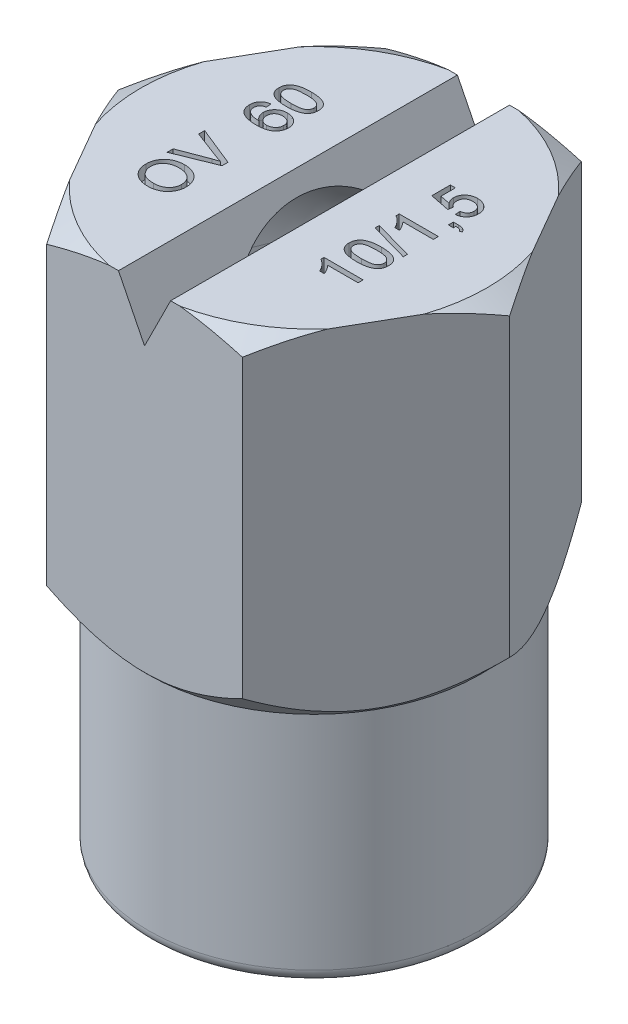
from build123d import *

# Parameters (mm, degrees)
ESTRUSIONE1_DEPTH        = 22
TAGLIO_ESTRUSIONE1_DEPTH = 27.633312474
SCHIZZO4_R               = 16.35
SCHIZZO4_R_2             = 6.35
TAGLIO_ESTRUSIONE2_DEPTH = 9
SMUSSO1_SIZE             = 1
RACCORDO1_R              = 0.5
TAGLIO_ESTRUSIONE3_DEPTH = 0.5
TAGLIO_ESTRUSIONE4_DEPTH = 0.5


with BuildPart() as part:
    # Schizzo1 → Estrusione1 (new body)
    with BuildSketch(Plane(origin=(0, 0, 0), x_dir=(1, 0, 0), z_dir=(0, 1, 0))):
        Polygon((3.75277675, -6.5), (7.505553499, 0), (3.75277675, 6.5), (-3.75277675, 6.5), (-7.505553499, 0), (-3.75277675, -6.5), align=None)
    extrude(amount=ESTRUSIONE1_DEPTH)

    # Schizzo2 → Taglio-Estrusione1 (cut, through all)
    with BuildSketch(Plane.XY.offset(6.5)):
        Polygon((-1, 22), (0, 20), (1, 22), align=None)
    extrude(amount=-TAGLIO_ESTRUSIONE1_DEPTH, mode=Mode.SUBTRACT)

    # Schizzo3 → Taglia-Rivoluzione1 (revolve, cut)
    with BuildSketch(Plane.XY, mode=Mode.PRIVATE) as taglia_rivoluzione1_sk:
        with BuildLine():
            Line((3.75, 0), (3.75, 17.65))
            ThreePointArc((3.75, 17.65), (2.651650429, 20.301650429), (0, 21.4))
            Line((0, 21.4), (0, 0))
            Line((0, 0), (3.75, 0))
        make_face()
    revolve(taglia_rivoluzione1_sk.sketch.rotate(Axis((0, 0, 0), (0, 1, 0)), 90), axis=Axis((0, 0, 0), (0, 1, 0)), mode=Mode.SUBTRACT)

    # Schizzo4 → Taglio-Estrusione2 (cut)
    with BuildSketch(Plane.XZ):
        Circle(SCHIZZO4_R)
        with Locations(Location((0, 0, 0), (0, 0, 270))):
            Circle(SCHIZZO4_R_2, mode=Mode.SUBTRACT)
    extrude(amount=-TAGLIO_ESTRUSIONE2_DEPTH, mode=Mode.SUBTRACT)

    # Schizzo5 → Taglia-Rivoluzione4 (revolve, cut)
    with BuildSketch(Plane.XY):
        Polygon((3, 24.101282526), (10.505553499, 19.767949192), (10.505553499, 24.101282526), align=None)
    revolve(axis=Axis((0, 0, 0), (0, 1, 0)), mode=Mode.SUBTRACT)

    # Schizzo6 → Taglia-Rivoluzione5 (revolve, cut)
    with BuildSketch(Plane.XY, mode=Mode.PRIVATE) as taglia_rivoluzione5_sk:
        Polygon((8.35, 11), (6.35, 9), (8.35, 9), align=None)
    revolve(taglia_rivoluzione5_sk.sketch.rotate(Axis((0, 0, 0), (0, 1, 0)), 300.000000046), axis=Axis((0, 0, 0), (0, 1, 0)), mode=Mode.SUBTRACT)

    # Smusso1
    smusso1_edges = [part.edges().sort_by_distance(p)[0] for p in [
        (0, 0, 3.75),
    ]]
    chamfer(smusso1_edges, length=SMUSSO1_SIZE)

    # Raccordo1
    raccordo1_edges = [part.edges().sort_by_distance(p)[0] for p in [
        (0, 0, 6.35),
    ]]
    fillet(raccordo1_edges, radius=RACCORDO1_R)

    # Schizzo7 → Taglio-Estrusione3 (cut)
    # profile 1 of 4: a face of its own
    with BuildSketch(Plane(origin=(0, 22, 0), x_dir=(-1, 0, 0), z_dir=(0, 1, 0))):
        with BuildLine():
            add(Edge.make_bspline(
                [(3.230168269, 3.134615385), (3.260240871, 3.134090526), (3.318835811, 3.133067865), (3.404175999, 3.1236252), (3.484374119, 3.108047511), (3.559801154, 3.086618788), (3.62988824, 3.058117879), (3.69549722, 3.024300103), (3.75548616, 2.983268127), (3.810548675, 2.936904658), (3.859223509, 2.885104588), (3.902454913, 2.829955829), (3.938514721, 2.770765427), (3.968288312, 2.708081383), (3.991147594, 2.64163708), (4.007151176, 2.571619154), (4.01747504, 2.498102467), (4.018637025, 2.447852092), (4.019230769, 2.422175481)],
                knots=[0, 0, 0, 0, 1.203593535, 2.345140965, 3.431924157, 4.471254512, 5.478692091, 6.45615896, 7.42038538, 8.382007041, 9.33218277, 10.260966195, 11.182476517, 12.100814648, 13.034113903, 13.98924309, 14.972556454, 16, 16, 16, 16], degree=3))
            add(Edge.make_bspline(
                [(4.019230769, 2.422175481), (4.01893768, 2.405239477), (4.018355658, 2.371607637), (4.013839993, 2.321796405), (4.005996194, 2.273326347), (3.995095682, 2.226162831), (3.981340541, 2.180259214), (3.964488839, 2.135521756), (3.944212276, 2.092237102), (3.921262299, 2.050291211), (3.895297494, 2.010338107), (3.867205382, 1.972415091), (3.836366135, 1.937143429), (3.80322624, 1.904312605), (3.767770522, 1.873851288), (3.729558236, 1.846138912), (3.689172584, 1.820615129), (3.646299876, 1.79782947), (3.601799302, 1.777418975), (3.555446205, 1.759984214), (3.507807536, 1.745010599), (3.458598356, 1.732477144), (3.407836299, 1.723483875), (3.355739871, 1.71632249), (3.302138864, 1.712553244), (3.265930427, 1.711879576), (3.247596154, 1.711538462)],
                knots=[0, 0, 0, 0, 1.034309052, 2.053950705, 3.051627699, 4.031038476, 5.008402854, 5.97643726, 6.948041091, 7.925482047, 8.894385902, 9.856059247, 10.805611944, 11.752954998, 12.703138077, 13.657545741, 14.63347317, 15.618750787, 16.620694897, 17.621667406, 18.641309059, 19.669521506, 20.720627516, 21.788266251, 22.880080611, 24, 24, 24, 24], degree=3))
            add(Edge.make_bspline(
                [(3.247596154, 1.711538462), (3.228959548, 1.711850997), (3.19213972, 1.712468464), (3.137745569, 1.716646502), (3.084912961, 1.723992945), (3.033484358, 1.73373675), (2.983566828, 1.746793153), (2.935017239, 1.762308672), (2.88812482, 1.781075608), (2.842776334, 1.802270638), (2.799596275, 1.826253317), (2.758883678, 1.852705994), (2.721029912, 1.881655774), (2.68553202, 1.912632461), (2.653219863, 1.946416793), (2.623145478, 1.982283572), (2.59626779, 2.020833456), (2.571826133, 2.06132541), (2.550816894, 2.103623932), (2.531955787, 2.146778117), (2.516088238, 2.190839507), (2.503106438, 2.235698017), (2.493193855, 2.281391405), (2.485963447, 2.327836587), (2.481699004, 2.37522067), (2.481080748, 2.407042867), (2.480769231, 2.423076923)],
                knots=[0, 0, 0, 0, 1.141388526, 2.255009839, 3.338557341, 4.406873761, 5.458773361, 6.496627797, 7.526383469, 8.5499449, 9.560445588, 10.548978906, 11.520676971, 12.476877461, 13.431305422, 14.380871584, 15.340724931, 16.306479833, 17.274880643, 18.230982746, 19.189541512, 20.140849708, 21.088988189, 22.051132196, 23.018035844, 24, 24, 24, 24], degree=3))
            add(Edge.make_bspline(
                [(2.480769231, 2.423076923), (2.481024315, 2.440316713), (2.481529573, 2.474464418), (2.486572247, 2.5249358), (2.494266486, 2.57415094), (2.505369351, 2.621969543), (2.519872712, 2.668316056), (2.537325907, 2.713198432), (2.557822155, 2.756725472), (2.581580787, 2.79859958), (2.60780825, 2.838781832), (2.636841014, 2.87645764), (2.668039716, 2.911734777), (2.701874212, 2.944180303), (2.737701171, 2.974304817), (2.775752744, 3.002165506), (2.816253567, 3.027338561), (2.858977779, 3.049692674), (2.902843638, 3.06984971), (2.94782757, 3.086841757), (2.99327668, 3.101771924), (3.039468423, 3.113662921), (3.086296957, 3.12313843), (3.13368417, 3.129510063), (3.181700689, 3.134111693), (3.213931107, 3.134446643), (3.230168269, 3.134615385)],
                knots=[0, 0, 0, 0, 1.072763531, 2.124875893, 3.153923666, 4.171672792, 5.177320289, 6.174136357, 7.166947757, 8.169130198, 9.168574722, 10.151174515, 11.127106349, 12.097106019, 13.066163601, 14.038804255, 15.030068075, 16.031241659, 17.038395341, 18.032966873, 19.022680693, 20.014630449, 21.000093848, 21.9946263, 22.989725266, 24, 24, 24, 24], degree=3))
        make_face()
        with BuildLine():
            add(Edge.make_bspline(
                [(3.227764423, 2.923076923), (3.206108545, 2.922752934), (3.163881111, 2.922121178), (3.102317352, 2.914886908), (3.044222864, 2.903922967), (2.989461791, 2.888766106), (2.938436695, 2.868529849), (2.891049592, 2.84378864), (2.847076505, 2.814766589), (2.807015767, 2.781478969), (2.771015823, 2.744903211), (2.739558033, 2.70581766), (2.713326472, 2.664258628), (2.691416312, 2.62077635), (2.674534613, 2.574794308), (2.662600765, 2.526532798), (2.655151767, 2.475992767), (2.65428678, 2.441532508), (2.653846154, 2.423978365)],
                knots=[0, 0, 0, 0, 1.215616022, 2.370365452, 3.475740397, 4.533490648, 5.5560781, 6.552384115, 7.530550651, 8.509299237, 9.471863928, 10.40830403, 11.321168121, 12.226759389, 13.137923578, 14.065605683, 15.014614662, 16, 16, 16, 16], degree=3))
            add(Edge.make_bspline(
                [(2.653846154, 2.423978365), (2.654292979, 2.406126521), (2.655167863, 2.37117266), (2.662491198, 2.31987291), (2.674958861, 2.271132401), (2.691556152, 2.224468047), (2.713992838, 2.18072342), (2.740266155, 2.138875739), (2.772371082, 2.100064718), (2.808435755, 2.063341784), (2.849425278, 2.030391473), (2.89435146, 2.001202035), (2.943772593, 1.977327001), (2.996977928, 1.957410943), (3.054301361, 1.941788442), (3.115742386, 1.930866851), (3.181139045, 1.924131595), (3.226044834, 1.923434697), (3.249098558, 1.923076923)],
                knots=[0, 0, 0, 0, 0.976909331, 1.912785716, 2.828990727, 3.727421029, 4.617481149, 5.514840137, 6.426786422, 7.368873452, 8.327895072, 9.299698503, 10.295216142, 11.325792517, 12.405818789, 13.542541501, 14.738390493, 16, 16, 16, 16], degree=3))
            add(Edge.make_bspline(
                [(3.249098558, 1.923076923), (3.263929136, 1.923204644), (3.293021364, 1.923455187), (3.33590364, 1.926773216), (3.377452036, 1.931053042), (3.417612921, 1.937569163), (3.456220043, 1.946549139), (3.493567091, 1.956497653), (3.529333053, 1.96893708), (3.563655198, 1.983054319), (3.596368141, 1.998840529), (3.62715708, 2.01668407), (3.65609493, 2.036237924), (3.683101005, 2.057541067), (3.708231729, 2.080518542), (3.731426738, 2.105235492), (3.752821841, 2.131752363), (3.772231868, 2.159915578), (3.789715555, 2.189280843), (3.804662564, 2.219805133), (3.817884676, 2.251065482), (3.827775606, 2.283492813), (3.836062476, 2.316562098), (3.842168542, 2.350467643), (3.845376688, 2.385453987), (3.845892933, 2.409048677), (3.846153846, 2.420973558)],
                knots=[0, 0, 0, 0, 1.220471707, 2.394123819, 3.538599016, 4.658184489, 5.740257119, 6.800339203, 7.838063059, 8.854709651, 9.853990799, 10.825506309, 11.781362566, 12.726491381, 13.654344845, 14.581758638, 15.513997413, 16.45624495, 17.395131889, 18.32430312, 19.252156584, 20.185670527, 21.111507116, 22.057642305, 23.018322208, 24, 24, 24, 24], degree=3))
            add(Edge.make_bspline(
                [(3.846153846, 2.420973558), (3.845810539, 2.437825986), (3.845131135, 2.471176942), (3.837894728, 2.52015271), (3.826787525, 2.567318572), (3.811535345, 2.612759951), (3.791102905, 2.656227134), (3.766493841, 2.698008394), (3.737360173, 2.737911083), (3.704053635, 2.775910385), (3.665612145, 2.811320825), (3.620324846, 2.841275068), (3.569234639, 2.866516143), (3.512481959, 2.887593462), (3.449624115, 2.903663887), (3.380932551, 2.914770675), (3.306334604, 2.921783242), (3.254624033, 2.922634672), (3.227764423, 2.923076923)],
                knots=[0, 0, 0, 0, 0.895069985, 1.771343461, 2.624796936, 3.468163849, 4.31361133, 5.172690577, 6.041527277, 6.935393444, 7.854933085, 8.810158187, 9.810009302, 10.877887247, 12.021813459, 13.252239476, 14.572752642, 16, 16, 16, 16], degree=3))
        make_face(mode=Mode.SUBTRACT)
    # profile 2 of 4: a face of its own
    with BuildSketch(Plane(origin=(0, 22, 0), x_dir=(-1, 0, 0), z_dir=(0, 1, 0))):
        with BuildLine():
            Line((2.5, 1.028245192), (4, 1.633112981))
            Line((4, 1.633112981), (4, 1.403846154))
            Line((4, 1.403846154), (2.924879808, 0.995793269))
            add(Edge.make_bspline(
                [(2.924879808, 0.995793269), (2.903687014, 0.987766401), (2.862260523, 0.972075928), (2.800498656, 0.950876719), (2.741157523, 0.930832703), (2.701859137, 0.91915638), (2.682692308, 0.913461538)],
                knots=[0, 0, 0, 0, 1.062769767, 2.077443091, 3.062319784, 4, 4, 4, 4], degree=3))
            add(Edge.make_bspline(
                [(2.682692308, 0.913461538), (2.723198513, 0.901262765), (2.804791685, 0.876690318), (2.884660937, 0.846988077), (2.924879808, 0.83203125)],
                knots=[0, 0, 0, 0, 0.992882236, 2, 2, 2, 2], degree=3))
            Line((2.924879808, 0.83203125), (4, 0.423076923))
            Line((4, 0.423076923), (4, 0.193810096))
            Line((4, 0.193810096), (2.5, 0.798978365))
            Line((2.5, 0.798978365), (2.5, 1.028245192))
        make_face()
    # profile 3 of 4: a face of its own
    with BuildSketch(Plane(origin=(0, 22, 0), x_dir=(-1, 0, 0), z_dir=(0, 1, 0))):
        with BuildLine():
            Line((3.615384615, -1.961538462), (3.596153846, -1.769230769))
            add(Edge.make_bspline(
                [(3.596153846, -1.769230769), (3.612693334, -1.765080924), (3.643826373, -1.757269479), (3.686053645, -1.740888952), (3.721770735, -1.72283796), (3.741003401, -1.707155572), (3.75, -1.699819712)],
                knots=[0, 0, 0, 0, 1.199207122, 2.257322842, 3.184815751, 4, 4, 4, 4], degree=3))
            add(Edge.make_bspline(
                [(3.75, -1.699819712), (3.756136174, -1.693522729), (3.768204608, -1.681138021), (3.783935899, -1.660806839), (3.797264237, -1.639374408), (3.808062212, -1.616775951), (3.816591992, -1.593133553), (3.822559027, -1.568349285), (3.826252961, -1.542479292), (3.826697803, -1.524852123), (3.826923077, -1.515925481)],
                knots=[0, 0, 0, 0, 1.028360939, 2.022547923, 3.001693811, 3.976902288, 4.948369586, 5.937776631, 6.955661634, 8, 8, 8, 8], degree=3))
            add(Edge.make_bspline(
                [(3.826923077, -1.515925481), (3.826457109, -1.501453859), (3.825536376, -1.472858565), (3.81652247, -1.430904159), (3.803031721, -1.390154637), (3.789356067, -1.364908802), (3.782451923, -1.352163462)],
                knots=[0, 0, 0, 0, 1.010336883, 1.996381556, 2.988474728, 4, 4, 4, 4], degree=3))
            add(Edge.make_bspline(
                [(3.782451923, -1.352163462), (3.772063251, -1.339634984), (3.750737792, -1.313917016), (3.711449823, -1.280280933), (3.66538697, -1.250666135), (3.622701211, -1.228390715), (3.584232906, -1.21294135), (3.551454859, -1.202378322), (3.51503182, -1.193902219), (3.475318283, -1.186684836), (3.432175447, -1.181148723), (3.385599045, -1.176507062), (3.335464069, -1.17394308), (3.300883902, -1.173371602), (3.283052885, -1.173076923)],
                knots=[0, 0, 0, 0, 1.063450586, 2.183009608, 3.366294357, 4.641264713, 5.326401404, 6.07664488, 6.892063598, 7.77129542, 8.7166684, 9.737191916, 10.833199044, 12, 12, 12, 12], degree=3))
            add(Edge.make_bspline(
                [(3.283052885, -1.173076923), (3.298977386, -1.184418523), (3.330150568, -1.206620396), (3.371063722, -1.245774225), (3.405335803, -1.288792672), (3.432985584, -1.335202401), (3.454229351, -1.383978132), (3.469704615, -1.434036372), (3.47906848, -1.485426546), (3.480199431, -1.520093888), (3.480769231, -1.537560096)],
                knots=[0, 0, 0, 0, 1.084049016, 2.12209208, 3.130949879, 4.128207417, 5.11149915, 6.076901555, 7.031098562, 8, 8, 8, 8], degree=3))
            add(Edge.make_bspline(
                [(3.480769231, -1.537560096), (3.480365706, -1.552604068), (3.479568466, -1.582326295), (3.473213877, -1.626087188), (3.462219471, -1.667982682), (3.447552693, -1.708402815), (3.428088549, -1.74681276), (3.404934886, -1.783864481), (3.376914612, -1.818734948), (3.345405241, -1.851890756), (3.310380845, -1.882080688), (3.272682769, -1.908800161), (3.232222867, -1.931066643), (3.189271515, -1.949122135), (3.143985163, -1.963253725), (3.096235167, -1.973522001), (3.045927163, -1.979532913), (3.011534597, -1.980351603), (2.993990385, -1.980769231)],
                knots=[0, 0, 0, 0, 0.981571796, 1.939281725, 2.877861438, 3.804367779, 4.739823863, 5.68285443, 6.650639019, 7.653910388, 8.664247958, 9.663507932, 10.664113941, 11.671783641, 12.699293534, 13.755733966, 14.85516306, 16, 16, 16, 16], degree=3))
            add(Edge.make_bspline(
                [(2.993990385, -1.980769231), (2.970806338, -1.980016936), (2.925053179, -1.978532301), (2.85764103, -1.966738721), (2.792836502, -1.947430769), (2.741054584, -1.92527508), (2.702050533, -1.903651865), (2.674220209, -1.886285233), (2.648323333, -1.867175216), (2.623893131, -1.846946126), (2.60173865, -1.824715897), (2.580767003, -1.801759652), (2.562201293, -1.776802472), (2.544985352, -1.750855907), (2.530092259, -1.723389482), (2.516757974, -1.695169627), (2.50561325, -1.665934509), (2.49667544, -1.63576241), (2.489358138, -1.604788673), (2.484313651, -1.572851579), (2.481205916, -1.540026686), (2.48091592, -1.517835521), (2.480769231, -1.506610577)],
                knots=[0, 0, 0, 0, 1.777725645, 3.508298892, 5.231915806, 6.956149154, 7.815891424, 8.651536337, 9.470662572, 10.283276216, 11.081966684, 11.876395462, 12.66627801, 13.465448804, 14.263251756, 15.060721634, 15.858413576, 16.660607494, 17.473221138, 18.298093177, 19.139125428, 20, 20, 20, 20], degree=3))
            add(Edge.make_bspline(
                [(2.480769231, -1.506610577), (2.481296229, -1.487654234), (2.482329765, -1.450477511), (2.490231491, -1.396054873), (2.503558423, -1.344321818), (2.521833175, -1.295188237), (2.545450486, -1.248760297), (2.574621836, -1.205199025), (2.608986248, -1.16431695), (2.64856124, -1.126056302), (2.69439319, -1.091493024), (2.746908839, -1.061361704), (2.806544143, -1.036681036), (2.87255488, -1.015835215), (2.945565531, -1.000401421), (3.025104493, -0.988498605), (3.111478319, -0.982238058), (3.171265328, -0.981270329), (3.202223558, -0.980769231)],
                knots=[0, 0, 0, 0, 0.898449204, 1.762016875, 2.600428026, 3.426826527, 4.242280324, 5.064055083, 5.906691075, 6.769749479, 7.668135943, 8.621070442, 9.631748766, 10.722023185, 11.898351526, 13.165512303, 14.532277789, 16, 16, 16, 16], degree=3))
            add(Edge.make_bspline(
                [(3.202223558, -0.980769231), (3.219852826, -0.980890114), (3.254619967, -0.981128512), (3.30583194, -0.982845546), (3.3552207, -0.986231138), (3.402721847, -0.990681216), (3.44841142, -0.996414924), (3.492259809, -1.003145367), (3.534205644, -1.011732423), (3.574341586, -1.021180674), (3.612695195, -1.032141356), (3.649314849, -1.043919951), (3.683932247, -1.057590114), (3.716757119, -1.072262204), (3.747741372, -1.088227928), (3.777004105, -1.105225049), (3.804169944, -1.124013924), (3.821185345, -1.137526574), (3.829627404, -1.144230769)],
                knots=[0, 0, 0, 0, 1.280444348, 2.525197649, 3.720942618, 4.875526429, 5.989898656, 7.065115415, 8.096622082, 9.098853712, 10.059152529, 10.993162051, 11.891531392, 12.760921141, 13.603603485, 14.422073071, 15.217123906, 16, 16, 16, 16], degree=3))
            add(Edge.make_bspline(
                [(3.829627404, -1.144230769), (3.843252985, -1.156344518), (3.870110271, -1.180221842), (3.904803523, -1.221068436), (3.934436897, -1.264593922), (3.958378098, -1.311492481), (3.977043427, -1.361405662), (3.990592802, -1.414364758), (3.998450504, -1.470517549), (3.99947513, -1.50888945), (4, -1.528545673)],
                knots=[0, 0, 0, 0, 1.005002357, 1.980952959, 2.948226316, 3.90482984, 4.879026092, 5.883055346, 6.915583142, 8, 8, 8, 8], degree=3))
            add(Edge.make_bspline(
                [(4, -1.528545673), (3.999741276, -1.543181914), (3.999232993, -1.571935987), (3.994355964, -1.614068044), (3.986204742, -1.654143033), (3.975209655, -1.692250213), (3.96057379, -1.728168), (3.943228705, -1.762310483), (3.922363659, -1.794330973), (3.898263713, -1.823997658), (3.871612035, -1.851384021), (3.842184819, -1.875913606), (3.810348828, -1.897493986), (3.776037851, -1.916293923), (3.739414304, -1.932145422), (3.700320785, -1.945160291), (3.658767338, -1.955052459), (3.630045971, -1.959346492), (3.615384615, -1.961538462)],
                knots=[0, 0, 0, 0, 1.095988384, 2.15315746, 3.171326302, 4.156539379, 5.119213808, 6.072133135, 7.021027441, 7.975952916, 8.930907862, 9.879001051, 10.840359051, 11.807350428, 12.805278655, 13.825435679, 14.889953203, 16, 16, 16, 16], degree=3))
        make_face()
        with BuildLine():
            add(Edge.make_bspline(
                [(2.997896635, -1.173076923), (2.98283903, -1.173611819), (2.952921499, -1.174674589), (2.908514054, -1.18280357), (2.865186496, -1.196078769), (2.823420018, -1.21427258), (2.784614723, -1.236738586), (2.750230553, -1.263422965), (2.720772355, -1.293746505), (2.696176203, -1.327546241), (2.677274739, -1.364742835), (2.663585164, -1.404670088), (2.655311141, -1.447375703), (2.654341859, -1.476825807), (2.653846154, -1.491887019)],
                knots=[0, 0, 0, 0, 1.034121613, 2.054667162, 3.090870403, 4.141799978, 5.178094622, 6.163726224, 7.122467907, 8.07367165, 9.024701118, 9.977919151, 10.965878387, 12, 12, 12, 12], degree=3))
            add(Edge.make_bspline(
                [(2.653846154, -1.491887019), (2.654135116, -1.502620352), (2.654699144, -1.52357087), (2.659107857, -1.554237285), (2.665771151, -1.583437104), (2.675969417, -1.611033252), (2.688453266, -1.637217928), (2.704057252, -1.661860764), (2.722343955, -1.684968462), (2.743428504, -1.706291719), (2.766871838, -1.725565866), (2.792537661, -1.742311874), (2.820001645, -1.757100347), (2.849939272, -1.768223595), (2.881583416, -1.777287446), (2.915233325, -1.783951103), (2.950927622, -1.787863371), (2.975450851, -1.788259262), (2.987980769, -1.788461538)],
                knots=[0, 0, 0, 0, 1.023462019, 1.997707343, 2.950204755, 3.875082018, 4.798131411, 5.712685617, 6.65128003, 7.603921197, 8.567945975, 9.540503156, 10.523517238, 11.53671457, 12.580096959, 13.661292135, 14.805058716, 16, 16, 16, 16], degree=3))
            add(Edge.make_bspline(
                [(2.987980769, -1.788461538), (3.000012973, -1.788273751), (3.023543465, -1.787906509), (3.057881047, -1.783780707), (3.090336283, -1.777757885), (3.120663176, -1.768556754), (3.149043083, -1.757132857), (3.175657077, -1.74336446), (3.200183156, -1.72673901), (3.2223571, -1.707374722), (3.242521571, -1.686147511), (3.260163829, -1.662819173), (3.274786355, -1.637510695), (3.287008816, -1.610475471), (3.296280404, -1.581524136), (3.302723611, -1.550700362), (3.307216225, -1.518160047), (3.307531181, -1.495809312), (3.307692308, -1.484375)],
                knots=[0, 0, 0, 0, 1.155383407, 2.259498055, 3.31823029, 4.322885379, 5.298549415, 6.25407473, 7.196229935, 8.137696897, 9.077096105, 10.004740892, 10.940535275, 11.8794908, 12.850254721, 13.854356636, 14.902319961, 16, 16, 16, 16], degree=3))
            add(Edge.make_bspline(
                [(3.307692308, -1.484375), (3.30752628, -1.473740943), (3.307199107, -1.452785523), (3.302668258, -1.422055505), (3.296223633, -1.39243306), (3.286815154, -1.364059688), (3.274850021, -1.336919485), (3.25984063, -1.311177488), (3.242524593, -1.28648581), (3.222313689, -1.26350833), (3.20040774, -1.242236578), (3.176405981, -1.223708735), (3.150763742, -1.208109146), (3.123491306, -1.194912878), (3.094377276, -1.185157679), (3.063662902, -1.178244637), (3.031370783, -1.173951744), (3.009228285, -1.173373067), (2.997896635, -1.173076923)],
                knots=[0, 0, 0, 0, 1.037172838, 2.043847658, 3.025909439, 3.99370322, 4.956694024, 5.916004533, 6.898066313, 7.896061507, 8.898787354, 9.874696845, 10.848988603, 11.824261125, 12.826080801, 13.838909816, 14.894039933, 16, 16, 16, 16], degree=3))
        make_face(mode=Mode.SUBTRACT)
    # profile 4 of 4: a face of its own
    with BuildSketch(Plane(origin=(0, 22, 0), x_dir=(-1, 0, 0), z_dir=(0, 1, 0))):
        with BuildLine():
            add(Edge.make_bspline(
                [(3.239783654, -2.173076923), (3.261220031, -2.173270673), (3.303204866, -2.173650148), (3.364636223, -2.176003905), (3.422975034, -2.180113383), (3.478170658, -2.18624767), (3.530347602, -2.193511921), (3.579431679, -2.202955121), (3.625532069, -2.213581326), (3.668603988, -2.226326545), (3.709006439, -2.240344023), (3.746714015, -2.256195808), (3.781503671, -2.274187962), (3.814320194, -2.292698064), (3.843626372, -2.314248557), (3.871278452, -2.336103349), (3.895697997, -2.360497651), (3.917684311, -2.386271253), (3.937079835, -2.413851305), (3.953817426, -2.443079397), (3.968595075, -2.473846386), (3.979719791, -2.506737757), (3.988788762, -2.541070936), (3.995460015, -2.577110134), (3.999392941, -2.614895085), (3.999795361, -2.640715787), (4, -2.653846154)],
                knots=[0, 0, 0, 0, 1.514715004, 2.966688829, 4.343277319, 5.646155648, 6.890271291, 8.064567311, 9.176982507, 10.231801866, 11.236819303, 12.197732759, 13.118802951, 14.00370591, 14.856056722, 15.686168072, 16.491905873, 17.290274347, 18.077650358, 18.870352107, 19.668187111, 20.485160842, 21.319455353, 22.17593919, 23.072426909, 24, 24, 24, 24], degree=3))
            add(Edge.make_bspline(
                [(4, -2.653846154), (3.999433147, -2.673109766), (3.998319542, -2.710953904), (3.989252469, -2.766212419), (3.973703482, -2.818267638), (3.952890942, -2.867111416), (3.925968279, -2.911687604), (3.894081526, -2.951988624), (3.855895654, -2.98638614), (3.812663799, -3.01601639), (3.764300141, -3.041424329), (3.711260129, -3.064152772), (3.653318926, -3.084530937), (3.601600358, -3.099446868), (3.556879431, -3.109904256), (3.519925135, -3.116271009), (3.480173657, -3.122149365), (3.437529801, -3.126316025), (3.392192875, -3.13055594), (3.34396519, -3.132649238), (3.292879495, -3.134246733), (3.25781406, -3.134490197), (3.239783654, -3.134615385)],
                knots=[0, 0, 0, 0, 1.134508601, 2.228787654, 3.287419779, 4.328790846, 5.347871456, 6.346850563, 7.345149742, 8.363256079, 9.427154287, 10.558404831, 11.760335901, 13.043439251, 13.7276639, 14.464993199, 15.251939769, 16.09452972, 16.988861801, 17.934185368, 18.937772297, 20, 20, 20, 20], degree=3))
            add(Edge.make_bspline(
                [(3.239783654, -3.134615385), (3.218447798, -3.134419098), (3.176764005, -3.134035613), (3.115827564, -3.13172975), (3.05792065, -3.127426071), (3.002972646, -3.121880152), (2.950932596, -3.114413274), (2.901927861, -3.105080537), (2.855898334, -3.094301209), (2.812797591, -3.082102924), (2.772566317, -3.067911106), (2.735011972, -3.05190461), (2.699766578, -3.034740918), (2.667486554, -3.015272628), (2.637637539, -2.994537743), (2.610125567, -2.972342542), (2.585341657, -2.948227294), (2.563427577, -2.922213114), (2.543683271, -2.894829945), (2.526793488, -2.865525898), (2.512703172, -2.834369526), (2.500926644, -2.801638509), (2.491976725, -2.767115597), (2.485331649, -2.730980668), (2.481362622, -2.692997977), (2.480969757, -2.667076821), (2.480769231, -2.653846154)],
                knots=[0, 0, 0, 0, 1.50892112, 2.947974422, 4.311604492, 5.614840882, 6.853004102, 8.028299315, 9.14166105, 10.195403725, 11.194594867, 12.156325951, 13.08133133, 13.964490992, 14.819271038, 15.650088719, 16.461567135, 17.260614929, 18.05275699, 18.846133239, 19.648095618, 20.468123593, 21.303127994, 22.167306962, 23.06455749, 24, 24, 24, 24], degree=3))
            add(Edge.make_bspline(
                [(2.480769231, -2.653846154), (2.481264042, -2.636499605), (2.482228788, -2.602678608), (2.488783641, -2.553285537), (2.500320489, -2.506927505), (2.51579303, -2.463213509), (2.536488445, -2.422634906), (2.561668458, -2.384997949), (2.59074723, -2.349546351), (2.613689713, -2.329138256), (2.625300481, -2.318810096)],
                knots=[0, 0, 0, 0, 1.10322584, 2.150986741, 3.161425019, 4.136713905, 5.093944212, 6.049774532, 7.013026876, 8, 8, 8, 8], degree=3))
            add(Edge.make_bspline(
                [(2.625300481, -2.318810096), (2.642449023, -2.306922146), (2.677810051, -2.282408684), (2.738103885, -2.253717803), (2.80447893, -2.228125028), (2.878237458, -2.208039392), (2.958792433, -2.192307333), (3.046301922, -2.180944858), (3.140728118, -2.174514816), (3.206019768, -2.173567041), (3.239783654, -2.173076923)],
                knots=[0, 0, 0, 0, 0.779365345, 1.607084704, 2.489375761, 3.438383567, 4.461919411, 5.557722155, 6.737039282, 8, 8, 8, 8], degree=3))
        make_face()
        with BuildLine():
            add(Edge.make_bspline(
                [(3.240384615, -2.365384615), (3.21153416, -2.365575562), (3.156308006, -2.365941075), (3.077407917, -2.369759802), (3.006229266, -2.376333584), (2.942870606, -2.385024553), (2.887246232, -2.396500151), (2.83949789, -2.410909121), (2.799052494, -2.427151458), (2.766411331, -2.447251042), (2.739804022, -2.469257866), (2.716920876, -2.491978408), (2.697470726, -2.515947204), (2.681253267, -2.54100786), (2.668974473, -2.56754921), (2.660074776, -2.59528103), (2.654953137, -2.624209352), (2.654217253, -2.643910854), (2.653846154, -2.653846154)],
                knots=[0, 0, 0, 0, 1.89448813, 3.626469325, 5.185477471, 6.587276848, 7.82441448, 8.910550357, 9.859733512, 10.6775885, 11.416198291, 12.123144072, 12.791880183, 13.439617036, 14.078171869, 14.70637855, 15.347637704, 16, 16, 16, 16], degree=3))
            add(Edge.make_bspline(
                [(2.653846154, -2.653846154), (2.654225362, -2.663778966), (2.654977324, -2.683475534), (2.659986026, -2.712470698), (2.669343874, -2.740094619), (2.6815793, -2.766596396), (2.697427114, -2.791839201), (2.716950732, -2.815690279), (2.73982029, -2.838530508), (2.766736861, -2.860438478), (2.799528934, -2.880384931), (2.839941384, -2.896931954), (2.887773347, -2.911116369), (2.943369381, -2.922654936), (3.006627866, -2.931381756), (3.077609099, -2.937915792), (3.15640767, -2.941760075), (3.211534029, -2.942119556), (3.240384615, -2.942307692)],
                knots=[0, 0, 0, 0, 0.652509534, 1.29391342, 1.924290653, 2.562989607, 3.207355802, 3.876242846, 4.583348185, 5.32723334, 6.150888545, 7.094226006, 8.186903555, 9.424320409, 10.81992305, 12.379283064, 14.105084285, 16, 16, 16, 16], degree=3))
            add(Edge.make_bspline(
                [(3.240384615, -2.942307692), (3.268634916, -2.942125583), (3.322761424, -2.941776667), (3.40014147, -2.937833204), (3.470125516, -2.931653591), (3.53277753, -2.923200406), (3.588031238, -2.911967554), (3.635998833, -2.898339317), (3.67659476, -2.882112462), (3.7101751, -2.862778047), (3.737894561, -2.841340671), (3.761420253, -2.818564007), (3.782036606, -2.794888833), (3.798179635, -2.768962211), (3.811419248, -2.74188632), (3.820282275, -2.71308074), (3.825970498, -2.682917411), (3.826600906, -2.662286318), (3.826923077, -2.651742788)],
                knots=[0, 0, 0, 0, 1.850145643, 3.544809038, 5.072983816, 6.450691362, 7.683229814, 8.76276662, 9.712991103, 10.538891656, 11.292051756, 12.001912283, 12.681449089, 13.342071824, 13.996410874, 14.649960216, 15.310061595, 16, 16, 16, 16], degree=3))
            add(Edge.make_bspline(
                [(3.826923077, -2.651742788), (3.826662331, -2.641808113), (3.826148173, -2.622218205), (3.821240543, -2.593536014), (3.81303389, -2.566354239), (3.801917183, -2.540361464), (3.786956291, -2.516206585), (3.769488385, -2.492931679), (3.74820569, -2.471626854), (3.732295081, -2.458788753), (3.724158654, -2.452223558)],
                knots=[0, 0, 0, 0, 1.021318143, 2.013908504, 2.982026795, 3.937174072, 4.91255697, 5.897578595, 6.924855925, 8, 8, 8, 8], degree=3))
            add(Edge.make_bspline(
                [(3.724158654, -2.452223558), (3.712208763, -2.445076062), (3.68697311, -2.429982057), (3.643112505, -2.413092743), (3.592988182, -2.398173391), (3.535828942, -2.385889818), (3.471732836, -2.377003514), (3.4007743, -2.369988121), (3.322854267, -2.366343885), (3.268632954, -2.365713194), (3.240384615, -2.365384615)],
                knots=[0, 0, 0, 0, 0.671104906, 1.417232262, 2.260109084, 3.195198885, 4.23592645, 5.382417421, 6.636286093, 8, 8, 8, 8], degree=3))
        make_face(mode=Mode.SUBTRACT)
    extrude(amount=-TAGLIO_ESTRUSIONE3_DEPTH, mode=Mode.SUBTRACT)

    # Schizzo8 → Taglio-Estrusione4 (cut)
    # profile 1 of 6: a face of its own
    with BuildSketch(Plane(origin=(0, 22, 0), x_dir=(-1, 0, 0), z_dir=(0, 1, 0))):
        with BuildLine():
            Line((-4, 2.115384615), (-4, 2.307692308))
            Line((-4, 2.307692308), (-2.831129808, 2.307692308))
            add(Edge.make_bspline(
                [(-2.831129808, 2.307692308), (-2.841807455, 2.318766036), (-2.863999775, 2.341781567), (-2.895427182, 2.38067387), (-2.927141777, 2.424073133), (-2.958052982, 2.471259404), (-2.986582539, 2.519729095), (-3.012615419, 2.566426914), (-3.034532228, 2.610700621), (-3.046527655, 2.639855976), (-3.052283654, 2.653846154)],
                knots=[0, 0, 0, 0, 0.89334793, 1.85672577, 2.901900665, 4.015525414, 5.132247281, 6.168817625, 7.121308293, 8, 8, 8, 8], degree=3))
            Line((-3.052283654, 2.653846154), (-2.875, 2.653846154))
            add(Edge.make_bspline(
                [(-2.875, 2.653846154), (-2.862624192, 2.629815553), (-2.838232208, 2.58245266), (-2.796103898, 2.515539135), (-2.750435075, 2.453068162), (-2.701235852, 2.396073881), (-2.650945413, 2.344982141), (-2.600200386, 2.301926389), (-2.550860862, 2.265900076), (-2.516452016, 2.247824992), (-2.5, 2.239182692)],
                knots=[0, 0, 0, 0, 1.141258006, 2.249351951, 3.335817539, 4.406819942, 5.426913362, 6.360259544, 7.215985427, 8, 8, 8, 8], degree=3))
            Line((-2.5, 2.239182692), (-2.5, 2.115384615))
            Line((-2.5, 2.115384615), (-4, 2.115384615))
        make_face()
    # profile 2 of 6: a face of its own
    with BuildSketch(Plane(origin=(0, 22, 0), x_dir=(-1, 0, 0), z_dir=(0, 1, 0))):
        with BuildLine():
            add(Edge.make_bspline(
                [(-3.260216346, 1.634615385), (-3.238779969, 1.634421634), (-3.196795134, 1.634042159), (-3.135363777, 1.631688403), (-3.077024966, 1.627578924), (-3.021829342, 1.621444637), (-2.969652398, 1.614180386), (-2.920568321, 1.604737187), (-2.874467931, 1.594110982), (-2.831396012, 1.581365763), (-2.790993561, 1.567348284), (-2.753285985, 1.551496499), (-2.718496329, 1.533504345), (-2.685679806, 1.514994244), (-2.656373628, 1.493443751), (-2.628721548, 1.471588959), (-2.604302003, 1.447194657), (-2.582315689, 1.421421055), (-2.562920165, 1.393841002), (-2.546182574, 1.364612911), (-2.531404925, 1.333845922), (-2.520280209, 1.300954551), (-2.511211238, 1.266621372), (-2.504539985, 1.230582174), (-2.500607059, 1.192797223), (-2.500204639, 1.166976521), (-2.5, 1.153846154)],
                knots=[0, 0, 0, 0, 1.514715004, 2.966688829, 4.343277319, 5.646155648, 6.890271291, 8.064567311, 9.176982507, 10.231801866, 11.236819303, 12.197732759, 13.118802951, 14.00370591, 14.856056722, 15.686168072, 16.491905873, 17.290274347, 18.077650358, 18.870352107, 19.668187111, 20.485160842, 21.319455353, 22.17593919, 23.072426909, 24, 24, 24, 24], degree=3))
            add(Edge.make_bspline(
                [(-2.5, 1.153846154), (-2.500566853, 1.134582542), (-2.501680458, 1.096738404), (-2.510747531, 1.041479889), (-2.526296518, 0.98942467), (-2.547109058, 0.940580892), (-2.574031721, 0.896004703), (-2.605918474, 0.855703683), (-2.644104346, 0.821306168), (-2.687336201, 0.791675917), (-2.735699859, 0.766267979), (-2.788739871, 0.743539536), (-2.846681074, 0.723161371), (-2.898399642, 0.70824544), (-2.943120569, 0.697788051), (-2.980074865, 0.691421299), (-3.019826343, 0.685542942), (-3.062470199, 0.681376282), (-3.107807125, 0.677136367), (-3.15603481, 0.67504307), (-3.207120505, 0.673445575), (-3.24218594, 0.673202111), (-3.260216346, 0.673076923)],
                knots=[0, 0, 0, 0, 1.134508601, 2.228787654, 3.287419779, 4.328790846, 5.347871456, 6.346850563, 7.345149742, 8.363256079, 9.427154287, 10.558404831, 11.760335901, 13.043439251, 13.7276639, 14.464993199, 15.251939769, 16.09452972, 16.988861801, 17.934185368, 18.937772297, 20, 20, 20, 20], degree=3))
            add(Edge.make_bspline(
                [(-3.260216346, 0.673076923), (-3.281552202, 0.67327321), (-3.323235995, 0.673656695), (-3.384172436, 0.675962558), (-3.44207935, 0.680266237), (-3.497027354, 0.685812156), (-3.549067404, 0.693279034), (-3.598072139, 0.702611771), (-3.644101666, 0.713391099), (-3.687202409, 0.725589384), (-3.727433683, 0.739781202), (-3.764988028, 0.755787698), (-3.800233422, 0.772951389), (-3.832513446, 0.79241968), (-3.862362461, 0.813154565), (-3.889874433, 0.835349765), (-3.914658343, 0.859465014), (-3.936572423, 0.885479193), (-3.956316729, 0.912862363), (-3.973206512, 0.94216641), (-3.987296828, 0.973322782), (-3.999073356, 1.006053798), (-4.008023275, 1.040576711), (-4.014668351, 1.07671164), (-4.018637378, 1.114694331), (-4.019030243, 1.140615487), (-4.019230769, 1.153846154)],
                knots=[0, 0, 0, 0, 1.50892112, 2.947974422, 4.311604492, 5.614840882, 6.853004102, 8.028299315, 9.14166105, 10.195403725, 11.194594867, 12.156325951, 13.08133133, 13.964490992, 14.819271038, 15.650088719, 16.461567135, 17.260614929, 18.05275699, 18.846133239, 19.648095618, 20.468123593, 21.303127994, 22.167306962, 23.06455749, 24, 24, 24, 24], degree=3))
            add(Edge.make_bspline(
                [(-4.019230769, 1.153846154), (-4.018735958, 1.171192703), (-4.017771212, 1.205013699), (-4.011216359, 1.254406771), (-3.999679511, 1.300764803), (-3.98420697, 1.344478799), (-3.963511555, 1.385057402), (-3.938331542, 1.422694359), (-3.90925277, 1.458145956), (-3.886310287, 1.478554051), (-3.874699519, 1.488882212)],
                knots=[0, 0, 0, 0, 1.10322584, 2.150986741, 3.161425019, 4.136713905, 5.093944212, 6.049774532, 7.013026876, 8, 8, 8, 8], degree=3))
            add(Edge.make_bspline(
                [(-3.874699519, 1.488882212), (-3.857550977, 1.500770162), (-3.822189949, 1.525283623), (-3.761896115, 1.553974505), (-3.69552107, 1.57956728), (-3.621762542, 1.599652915), (-3.541207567, 1.615384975), (-3.453698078, 1.62674745), (-3.359271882, 1.633177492), (-3.293980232, 1.634125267), (-3.260216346, 1.634615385)],
                knots=[0, 0, 0, 0, 0.779365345, 1.607084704, 2.489375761, 3.438383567, 4.461919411, 5.557722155, 6.737039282, 8, 8, 8, 8], degree=3))
        make_face()
        with BuildLine():
            add(Edge.make_bspline(
                [(-3.259615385, 1.442307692), (-3.28846584, 1.442116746), (-3.343691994, 1.441751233), (-3.422592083, 1.437932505), (-3.493770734, 1.431358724), (-3.557129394, 1.422667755), (-3.612753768, 1.411192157), (-3.66050211, 1.396783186), (-3.700947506, 1.38054085), (-3.733588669, 1.360441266), (-3.760195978, 1.338434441), (-3.783079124, 1.315713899), (-3.802529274, 1.291745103), (-3.818746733, 1.266684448), (-3.831025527, 1.240143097), (-3.839925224, 1.212411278), (-3.845046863, 1.183482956), (-3.845782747, 1.163781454), (-3.846153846, 1.153846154)],
                knots=[0, 0, 0, 0, 1.89448813, 3.626469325, 5.185477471, 6.587276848, 7.82441448, 8.910550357, 9.859733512, 10.6775885, 11.416198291, 12.123144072, 12.791880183, 13.439617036, 14.078171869, 14.70637855, 15.347637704, 16, 16, 16, 16], degree=3))
            add(Edge.make_bspline(
                [(-3.846153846, 1.153846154), (-3.845774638, 1.143913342), (-3.845022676, 1.124216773), (-3.840013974, 1.095221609), (-3.830656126, 1.067597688), (-3.8184207, 1.041095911), (-3.802572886, 1.015853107), (-3.783049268, 0.992002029), (-3.76017971, 0.9691618), (-3.733263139, 0.947253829), (-3.700471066, 0.927307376), (-3.660058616, 0.910760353), (-3.612226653, 0.896575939), (-3.556630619, 0.885037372), (-3.493372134, 0.876310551), (-3.422390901, 0.869776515), (-3.34359233, 0.865932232), (-3.288465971, 0.865572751), (-3.259615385, 0.865384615)],
                knots=[0, 0, 0, 0, 0.652509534, 1.29391342, 1.924290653, 2.562989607, 3.207355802, 3.876242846, 4.583348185, 5.32723334, 6.150888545, 7.094226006, 8.186903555, 9.424320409, 10.81992305, 12.379283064, 14.105084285, 16, 16, 16, 16], degree=3))
            add(Edge.make_bspline(
                [(-3.259615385, 0.865384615), (-3.231365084, 0.865566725), (-3.177238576, 0.86591564), (-3.09985853, 0.869859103), (-3.029874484, 0.876038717), (-2.96722247, 0.884491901), (-2.911968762, 0.895724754), (-2.864001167, 0.909352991), (-2.82340524, 0.925579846), (-2.7898249, 0.94491426), (-2.762105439, 0.966351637), (-2.738579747, 0.989128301), (-2.717963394, 1.012803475), (-2.701820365, 1.038730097), (-2.688580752, 1.065805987), (-2.679717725, 1.094611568), (-2.674029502, 1.124774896), (-2.673399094, 1.14540599), (-2.673076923, 1.155949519)],
                knots=[0, 0, 0, 0, 1.850145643, 3.544809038, 5.072983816, 6.450691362, 7.683229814, 8.76276662, 9.712991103, 10.538891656, 11.292051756, 12.001912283, 12.681449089, 13.342071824, 13.996410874, 14.649960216, 15.310061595, 16, 16, 16, 16], degree=3))
            add(Edge.make_bspline(
                [(-2.673076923, 1.155949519), (-2.673337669, 1.165884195), (-2.673851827, 1.185474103), (-2.678759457, 1.214156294), (-2.68696611, 1.241338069), (-2.698082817, 1.267330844), (-2.713043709, 1.291485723), (-2.730511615, 1.314760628), (-2.75179431, 1.336065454), (-2.767704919, 1.348903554), (-2.775841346, 1.35546875)],
                knots=[0, 0, 0, 0, 1.021318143, 2.013908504, 2.982026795, 3.937174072, 4.91255697, 5.897578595, 6.924855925, 8, 8, 8, 8], degree=3))
            add(Edge.make_bspline(
                [(-2.775841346, 1.35546875), (-2.787791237, 1.362616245), (-2.81302689, 1.37771025), (-2.856887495, 1.394599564), (-2.907011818, 1.409518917), (-2.964171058, 1.42180249), (-3.028267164, 1.430688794), (-3.0992257, 1.437704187), (-3.177145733, 1.441348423), (-3.231367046, 1.441979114), (-3.259615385, 1.442307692)],
                knots=[0, 0, 0, 0, 0.671104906, 1.417232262, 2.260109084, 3.195198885, 4.23592645, 5.382417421, 6.636286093, 8, 8, 8, 8], degree=3))
        make_face(mode=Mode.SUBTRACT)
    # profile 3 of 6: a face of its own
    with BuildSketch(Plane(origin=(0, 22, 0), x_dir=(-1, 0, 0), z_dir=(0, 1, 0))):
        Polygon((-4, 0.576923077), (-2.5, 0.153846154), (-2.5, -0.005108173), (-4, 0.41796875), align=None)
    # profile 4 of 6: a face of its own
    with BuildSketch(Plane(origin=(0, 22, 0), x_dir=(-1, 0, 0), z_dir=(0, 1, 0))):
        with BuildLine():
            Line((-4, -0.769230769), (-4, -0.576923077))
            Line((-4, -0.576923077), (-2.831129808, -0.576923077))
            add(Edge.make_bspline(
                [(-2.831129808, -0.576923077), (-2.841807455, -0.565849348), (-2.863999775, -0.542833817), (-2.895427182, -0.503941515), (-2.927141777, -0.460542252), (-2.958052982, -0.413355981), (-2.986582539, -0.36488629), (-3.012615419, -0.318188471), (-3.034532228, -0.273914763), (-3.046527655, -0.244759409), (-3.052283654, -0.230769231)],
                knots=[0, 0, 0, 0, 0.89334793, 1.85672577, 2.901900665, 4.015525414, 5.132247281, 6.168817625, 7.121308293, 8, 8, 8, 8], degree=3))
            Line((-3.052283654, -0.230769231), (-2.875, -0.230769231))
            add(Edge.make_bspline(
                [(-2.875, -0.230769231), (-2.862624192, -0.254799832), (-2.838232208, -0.302162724), (-2.796103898, -0.369076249), (-2.750435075, -0.431547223), (-2.701235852, -0.488541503), (-2.650945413, -0.539633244), (-2.600200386, -0.582688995), (-2.550860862, -0.618715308), (-2.516452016, -0.636790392), (-2.5, -0.645432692)],
                knots=[0, 0, 0, 0, 1.141258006, 2.249351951, 3.335817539, 4.406819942, 5.426913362, 6.360259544, 7.215985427, 8, 8, 8, 8], degree=3))
            Line((-2.5, -0.645432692), (-2.5, -0.769230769))
            Line((-2.5, -0.769230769), (-4, -0.769230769))
        make_face()
    # profile 5 of 6: a face of its own
    with BuildSketch(Plane(origin=(0, 22, 0), x_dir=(-1, 0, 0), z_dir=(0, 1, 0))):
        with BuildLine():
            Line((-4, -1.346153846), (-3.807692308, -1.346153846))
            Line((-3.807692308, -1.346153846), (-3.807692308, -1.538461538))
            Line((-3.807692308, -1.538461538), (-4, -1.538461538))
            add(Edge.make_bspline(
                [(-4, -1.538461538), (-4.019052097, -1.538020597), (-4.055390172, -1.537179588), (-4.106990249, -1.530356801), (-4.152914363, -1.519013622), (-4.193727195, -1.503276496), (-4.229180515, -1.481494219), (-4.260121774, -1.454485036), (-4.286884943, -1.422100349), (-4.300661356, -1.397281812), (-4.307692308, -1.384615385)],
                knots=[0, 0, 0, 0, 1.252661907, 2.389202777, 3.414870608, 4.357956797, 5.253829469, 6.136233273, 7.048805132, 8, 8, 8, 8], degree=3))
            Line((-4.307692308, -1.384615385), (-4.230769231, -1.346153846))
            add(Edge.make_bspline(
                [(-4.230769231, -1.346153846), (-4.226016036, -1.353756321), (-4.216557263, -1.368885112), (-4.197748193, -1.388263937), (-4.175963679, -1.404608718), (-4.150539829, -1.417904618), (-4.120573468, -1.42770219), (-4.085408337, -1.435014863), (-4.044605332, -1.440074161), (-4.01544083, -1.441141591), (-4, -1.441706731)],
                knots=[0, 0, 0, 0, 0.818684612, 1.629167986, 2.454191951, 3.302962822, 4.242204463, 5.329983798, 6.586388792, 8, 8, 8, 8], degree=3))
            Line((-4, -1.441706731), (-4, -1.346153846))
        make_face()
    # profile 6 of 6: a face of its own
    with BuildSketch(Plane(origin=(0, 22, 0), x_dir=(-1, 0, 0), z_dir=(0, 1, 0))):
        with BuildLine():
            Line((-3.596153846, -1.826923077), (-3.576923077, -2.019230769))
            add(Edge.make_bspline(
                [(-3.576923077, -2.019230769), (-3.58775856, -2.021134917), (-3.60883526, -2.024838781), (-3.639344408, -2.031896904), (-3.667688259, -2.041063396), (-3.694112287, -2.051362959), (-3.718337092, -2.063605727), (-3.74074517, -2.076870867), (-3.760541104, -2.09251439), (-3.77876024, -2.108961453), (-3.794814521, -2.127013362), (-3.808348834, -2.146844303), (-3.820156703, -2.167900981), (-3.829824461, -2.190439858), (-3.836900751, -2.214495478), (-3.842496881, -2.239761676), (-3.845316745, -2.2665638), (-3.845871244, -2.284850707), (-3.846153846, -2.294170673)],
                knots=[0, 0, 0, 0, 1.237781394, 2.407677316, 3.51963579, 4.58689595, 5.594855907, 6.570874, 7.510833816, 8.428091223, 9.330271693, 10.221190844, 11.124215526, 12.043132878, 12.973586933, 13.941700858, 14.950982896, 16, 16, 16, 16], degree=3))
            add(Edge.make_bspline(
                [(-3.846153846, -2.294170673), (-3.845877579, -2.305604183), (-3.845337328, -2.327962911), (-3.840768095, -2.360490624), (-3.83323396, -2.391215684), (-3.822690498, -2.419991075), (-3.809578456, -2.447154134), (-3.792600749, -2.471803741), (-3.77351613, -2.495283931), (-3.7507636, -2.516083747), (-3.725993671, -2.535017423), (-3.69895624, -2.551358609), (-3.670030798, -2.565115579), (-3.639222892, -2.576697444), (-3.606356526, -2.585249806), (-3.571606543, -2.591540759), (-3.534950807, -2.5955793), (-3.509826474, -2.595959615), (-3.496995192, -2.596153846)],
                knots=[0, 0, 0, 0, 1.052816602, 2.058828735, 3.018813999, 3.961574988, 4.877590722, 5.788574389, 6.712363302, 7.658909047, 8.620312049, 9.580784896, 10.562948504, 11.56722449, 12.607883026, 13.686460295, 14.818448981, 16, 16, 16, 16], degree=3))
            add(Edge.make_bspline(
                [(-3.496995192, -2.596153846), (-3.484767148, -2.595933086), (-3.460956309, -2.595503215), (-3.426283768, -2.591882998), (-3.393681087, -2.585775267), (-3.362788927, -2.577872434), (-3.334090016, -2.566979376), (-3.307168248, -2.554059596), (-3.282594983, -2.538232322), (-3.259605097, -2.520623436), (-3.23899559, -2.500511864), (-3.221593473, -2.477625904), (-3.206363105, -2.452863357), (-3.194012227, -2.425725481), (-3.184835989, -2.396196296), (-3.1777757, -2.36456924), (-3.174062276, -2.330516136), (-3.173411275, -2.30709904), (-3.173076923, -2.295072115)],
                knots=[0, 0, 0, 0, 1.165854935, 2.270189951, 3.319242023, 4.32700288, 5.306253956, 6.24172124, 7.169108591, 8.088047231, 8.999810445, 9.905349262, 10.822648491, 11.767237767, 12.739852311, 13.766490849, 14.852878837, 16, 16, 16, 16], degree=3))
            add(Edge.make_bspline(
                [(-3.173076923, -2.295072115), (-3.173525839, -2.280119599), (-3.174389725, -2.251345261), (-3.18131565, -2.210101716), (-3.192883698, -2.172634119), (-3.209796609, -2.139313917), (-3.230105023, -2.109479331), (-3.253072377, -2.082579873), (-3.278697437, -2.058397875), (-3.297989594, -2.045132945), (-3.307692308, -2.038461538)],
                knots=[0, 0, 0, 0, 1.182839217, 2.276233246, 3.299105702, 4.274010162, 5.221622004, 6.149363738, 7.06924902, 8, 8, 8, 8], degree=3))
            Line((-3.307692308, -2.038461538), (-3.288461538, -1.846153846))
            Line((-3.288461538, -1.846153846), (-2.519230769, -2))
            Line((-2.519230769, -2), (-2.519230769, -2.711538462))
            Line((-2.519230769, -2.711538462), (-2.711538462, -2.711538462))
            Line((-2.711538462, -2.711538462), (-2.711538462, -2.157151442))
            Line((-2.711538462, -2.157151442), (-3.100060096, -2.080829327))
            add(Edge.make_bspline(
                [(-3.100060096, -2.080829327), (-3.092098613, -2.091440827), (-3.076463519, -2.112280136), (-3.055971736, -2.14477751), (-3.038815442, -2.177689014), (-3.024454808, -2.210841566), (-3.013648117, -2.24469477), (-3.005920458, -2.278879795), (-3.00076543, -2.313445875), (-3.000255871, -2.336620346), (-3, -2.348257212)],
                knots=[0, 0, 0, 0, 1.093799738, 2.148049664, 3.164132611, 4.152263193, 5.124065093, 6.089950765, 7.040884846, 8, 8, 8, 8], degree=3))
            add(Edge.make_bspline(
                [(-3, -2.348257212), (-3.000396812, -2.363402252), (-3.00117823, -2.393226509), (-3.00759858, -2.437173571), (-3.018497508, -2.479194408), (-3.033176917, -2.519618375), (-3.052636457, -2.557913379), (-3.076199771, -2.594463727), (-3.104052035, -2.629135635), (-3.135702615, -2.661679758), (-3.170686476, -2.69131967), (-3.208431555, -2.717296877), (-3.248673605, -2.739399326), (-3.291366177, -2.757410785), (-3.33658542, -2.771304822), (-3.384078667, -2.781067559), (-3.434031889, -2.787272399), (-3.468130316, -2.788059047), (-3.485576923, -2.788461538)],
                knots=[0, 0, 0, 0, 0.992032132, 1.95355186, 2.902219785, 3.832411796, 4.765723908, 5.710502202, 6.67700341, 7.674814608, 8.68064359, 9.676380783, 10.672053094, 11.683731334, 12.707113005, 13.766394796, 14.857166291, 16, 16, 16, 16], degree=3))
            add(Edge.make_bspline(
                [(-3.485576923, -2.788461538), (-3.502218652, -2.788124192), (-3.535090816, -2.787457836), (-3.583517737, -2.781900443), (-3.630269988, -2.772982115), (-3.675131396, -2.760222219), (-3.718498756, -2.744387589), (-3.759837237, -2.724325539), (-3.799967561, -2.70138845), (-3.824694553, -2.682955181), (-3.837139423, -2.673677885)],
                knots=[0, 0, 0, 0, 1.059762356, 2.093333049, 3.100576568, 4.08823236, 5.061210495, 6.037154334, 7.012117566, 8, 8, 8, 8], degree=3))
            add(Edge.make_bspline(
                [(-3.837139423, -2.673677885), (-3.851667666, -2.661894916), (-3.88024628, -2.638716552), (-3.91733961, -2.598583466), (-3.948863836, -2.555439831), (-3.974474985, -2.509028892), (-3.995055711, -2.459662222), (-4.008751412, -2.406733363), (-4.017948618, -2.350881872), (-4.018797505, -2.312538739), (-4.019230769, -2.29296875)],
                knots=[0, 0, 0, 0, 1.023140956, 2.012628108, 2.982342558, 3.942221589, 4.908720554, 5.902469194, 6.929439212, 8, 8, 8, 8], degree=3))
            add(Edge.make_bspline(
                [(-4.019230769, -2.29296875), (-4.018903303, -2.27682663), (-4.018262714, -2.245249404), (-4.012694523, -2.199014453), (-4.003813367, -2.155040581), (-3.991081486, -2.113309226), (-3.974971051, -2.073711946), (-3.95462793, -2.036718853), (-3.931068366, -2.001838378), (-3.903999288, -1.969520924), (-3.874130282, -1.939685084), (-3.84117381, -1.913588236), (-3.806039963, -1.890638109), (-3.768832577, -1.870530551), (-3.728819, -1.854877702), (-3.686802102, -1.841772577), (-3.642367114, -1.832054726), (-3.611719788, -1.828651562), (-3.596153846, -1.826923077)],
                knots=[0, 0, 0, 0, 1.108944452, 2.169317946, 3.195242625, 4.188124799, 5.163410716, 6.127483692, 7.083934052, 8.051587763, 9.020146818, 9.980082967, 10.934624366, 11.901494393, 12.880562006, 13.882043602, 14.924278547, 16, 16, 16, 16], degree=3))
        make_face()
    extrude(amount=-TAGLIO_ESTRUSIONE4_DEPTH, mode=Mode.SUBTRACT)


solid = part.part
